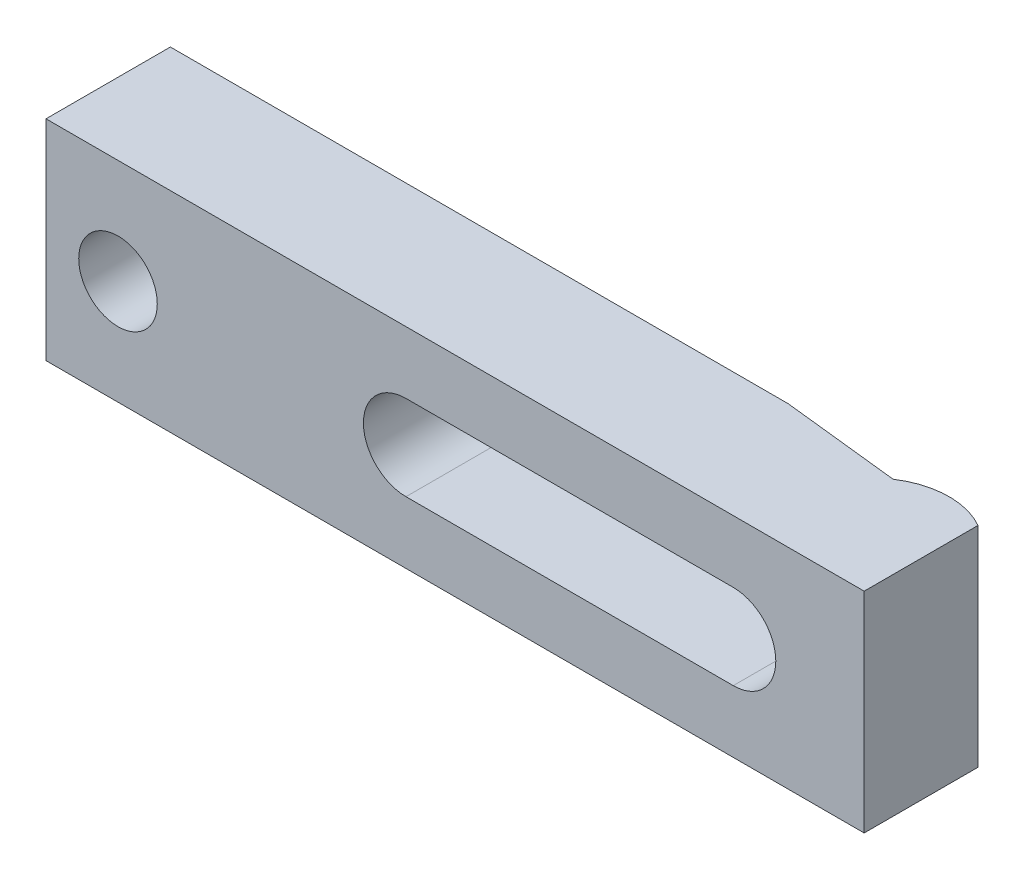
ISO-10303-21;
HEADER;
FILE_DESCRIPTION(('STEP AP214'),'2;1');
FILE_NAME('part.step','',(''),(''),'','','');
FILE_SCHEMA(('AUTOMOTIVE_DESIGN { 1 0 10303 214 1 1 1 1 }'));
ENDSEC;
DATA;
#1=APPLICATION_CONTEXT('core data for automotive mechanical design processes');
#2=APPLICATION_PROTOCOL_DEFINITION('international standard','automotive_design',2000,#1);
#3=PRODUCT_CONTEXT('',#1,'mechanical');
#4=PRODUCT('Part','Part','',(#3));
#5=PRODUCT_RELATED_PRODUCT_CATEGORY('part','',(#4));
#6=PRODUCT_DEFINITION_FORMATION('','',#4);
#7=PRODUCT_DEFINITION_CONTEXT('part definition',#1,'design');
#8=PRODUCT_DEFINITION('design','',#6,#7);
#9=PRODUCT_DEFINITION_SHAPE('','',#8);
#10=(LENGTH_UNIT() NAMED_UNIT(*) SI_UNIT(.MILLI.,.METRE.));
#11=(NAMED_UNIT(*) PLANE_ANGLE_UNIT() SI_UNIT($,.RADIAN.));
#12=(NAMED_UNIT(*) SI_UNIT($,.STERADIAN.) SOLID_ANGLE_UNIT());
#13=UNCERTAINTY_MEASURE_WITH_UNIT(LENGTH_MEASURE(1.E-05),#10,'distance_accuracy_value','');
#14=(GEOMETRIC_REPRESENTATION_CONTEXT(3) GLOBAL_UNCERTAINTY_ASSIGNED_CONTEXT((#13)) GLOBAL_UNIT_ASSIGNED_CONTEXT((#10,
#11,#12)) REPRESENTATION_CONTEXT('',''));
#15=CARTESIAN_POINT('',(0.,0.,0.));
#16=DIRECTION('',(0.,0.,1.));
#17=DIRECTION('',(1.,0.,0.));
#18=AXIS2_PLACEMENT_3D('',#15,#16,#17);
#19=CARTESIAN_POINT('',(-105.,16.,0.));
#20=DIRECTION('',(0.,0.,-1.));
#21=DIRECTION('',(-1.,0.,0.));
#22=AXIS2_PLACEMENT_3D('',#19,#20,#21);
#23=PLANE('',#22);
#24=DIRECTION('',(1.,0.,0.));
#25=VECTOR('',#24,1.);
#26=CARTESIAN_POINT('',(-50.,6.5,0.));
#27=LINE('',#26,#25);
#28=CARTESIAN_POINT('',(-105.,6.5,0.));
#29=VERTEX_POINT('',#28);
#30=CARTESIAN_POINT('',(-10.6,6.5,0.));
#31=VERTEX_POINT('',#30);
#32=EDGE_CURVE('E122',#29,#31,#27,.T.);
#33=ORIENTED_EDGE('',*,*,#32,.F.);
#34=DIRECTION('',(0.,-1.,0.));
#35=VECTOR('',#34,1.);
#36=CARTESIAN_POINT('',(-105.,16.,0.));
#37=LINE('',#36,#35);
#38=CARTESIAN_POINT('',(-105.,16.,0.));
#39=VERTEX_POINT('',#38);
#40=EDGE_CURVE('E139',#39,#29,#37,.T.);
#41=ORIENTED_EDGE('',*,*,#40,.F.);
#42=DIRECTION('',(1.,0.,0.));
#43=VECTOR('',#42,1.);
#44=CARTESIAN_POINT('',(-105.,16.,0.));
#45=LINE('',#44,#43);
#46=CARTESIAN_POINT('',(-10.6,16.,0.));
#47=VERTEX_POINT('',#46);
#48=EDGE_CURVE('E196',#39,#47,#45,.T.);
#49=ORIENTED_EDGE('',*,*,#48,.T.);
#50=DIRECTION('',(0.,-1.,0.));
#51=VECTOR('',#50,1.);
#52=CARTESIAN_POINT('',(-10.6,16.,0.));
#53=LINE('',#52,#51);
#54=EDGE_CURVE('E147',#47,#31,#53,.T.);
#55=ORIENTED_EDGE('',*,*,#54,.T.);
#56=EDGE_LOOP('',(#33,#41,#49,#55));
#57=FACE_BOUND('',#56,.T.);
#58=ADVANCED_FACE('F14',(#57),#23,.T.);
#59=CARTESIAN_POINT('',(-105.,16.,19.));
#60=DIRECTION('',(-1.,0.,0.));
#61=DIRECTION('',(0.,0.,1.));
#62=AXIS2_PLACEMENT_3D('',#59,#60,#61);
#63=PLANE('',#62);
#64=ORIENTED_EDGE('',*,*,#40,.T.);
#65=DIRECTION('',(0.,0.,1.));
#66=VECTOR('',#65,1.);
#67=CARTESIAN_POINT('',(-105.,6.5,19.));
#68=LINE('',#67,#66);
#69=CARTESIAN_POINT('',(-105.,6.5,5.));
#70=VERTEX_POINT('',#69);
#71=EDGE_CURVE('E133',#29,#70,#68,.T.);
#72=ORIENTED_EDGE('',*,*,#71,.T.);
#73=DIRECTION('',(0.,-1.,0.));
#74=VECTOR('',#73,1.);
#75=CARTESIAN_POINT('',(-105.,16.,5.));
#76=LINE('',#75,#74);
#77=CARTESIAN_POINT('',(-105.,-6.5,5.));
#78=VERTEX_POINT('',#77);
#79=EDGE_CURVE('E132',#70,#78,#76,.T.);
#80=ORIENTED_EDGE('',*,*,#79,.T.);
#81=DIRECTION('',(0.,0.,1.));
#82=VECTOR('',#81,1.);
#83=CARTESIAN_POINT('',(-105.,-6.5,19.));
#84=LINE('',#83,#82);
#85=CARTESIAN_POINT('',(-105.,-6.5,0.));
#86=VERTEX_POINT('',#85);
#87=EDGE_CURVE('E115',#86,#78,#84,.T.);
#88=ORIENTED_EDGE('',*,*,#87,.F.);
#89=CARTESIAN_POINT('',(-105.,-16.,0.));
#90=VERTEX_POINT('',#89);
#91=EDGE_CURVE('E129',#86,#90,#37,.T.);
#92=ORIENTED_EDGE('',*,*,#91,.T.);
#93=DIRECTION('',(0.,0.,-1.));
#94=VECTOR('',#93,1.);
#95=CARTESIAN_POINT('',(-105.,-16.,19.));
#96=LINE('',#95,#94);
#97=CARTESIAN_POINT('',(-105.,-16.,19.));
#98=VERTEX_POINT('',#97);
#99=EDGE_CURVE('E169',#98,#90,#96,.T.);
#100=ORIENTED_EDGE('',*,*,#99,.F.);
#101=DIRECTION('',(0.,-1.,0.));
#102=VECTOR('',#101,1.);
#103=CARTESIAN_POINT('',(-105.,16.,19.));
#104=LINE('',#103,#102);
#105=CARTESIAN_POINT('',(-105.,16.,19.));
#106=VERTEX_POINT('',#105);
#107=EDGE_CURVE('E140',#106,#98,#104,.T.);
#108=ORIENTED_EDGE('',*,*,#107,.F.);
#109=DIRECTION('',(0.,0.,-1.));
#110=VECTOR('',#109,1.);
#111=CARTESIAN_POINT('',(-105.,16.,19.));
#112=LINE('',#111,#110);
#113=EDGE_CURVE('E179',#106,#39,#112,.T.);
#114=ORIENTED_EDGE('',*,*,#113,.T.);
#115=EDGE_LOOP('',(#64,#72,#80,#88,#92,#100,#108,#114));
#116=FACE_BOUND('',#115,.T.);
#117=ADVANCED_FACE('F127',(#116),#63,.T.);
#118=CARTESIAN_POINT('',(-50.,0.,19.));
#119=DIRECTION('',(0.,0.,-1.));
#120=DIRECTION('',(-1.,0.,0.));
#121=AXIS2_PLACEMENT_3D('',#118,#119,#120);
#122=CYLINDRICAL_SURFACE('',#121,6.5);
#123=DIRECTION('',(0.,0.,-1.));
#124=VECTOR('',#123,1.);
#125=CARTESIAN_POINT('',(-50.,-6.5,19.));
#126=LINE('',#125,#124);
#127=CARTESIAN_POINT('',(-50.,-6.5,19.));
#128=VERTEX_POINT('',#127);
#129=CARTESIAN_POINT('',(-50.,-6.5,5.));
#130=VERTEX_POINT('',#129);
#131=EDGE_CURVE('E229',#128,#130,#126,.T.);
#132=ORIENTED_EDGE('',*,*,#131,.T.);
#133=CARTESIAN_POINT('',(-50.,0.,5.));
#134=DIRECTION('',(0.,0.,-1.));
#135=DIRECTION('',(-1.,0.,0.));
#136=AXIS2_PLACEMENT_3D('',#133,#134,#135);
#137=CIRCLE('',#136,6.5);
#138=CARTESIAN_POINT('',(-50.,6.5,5.));
#139=VERTEX_POINT('',#138);
#140=EDGE_CURVE('E245',#130,#139,#137,.T.);
#141=ORIENTED_EDGE('',*,*,#140,.T.);
#142=DIRECTION('',(0.,0.,-1.));
#143=VECTOR('',#142,1.);
#144=CARTESIAN_POINT('',(-50.,6.5,19.));
#145=LINE('',#144,#143);
#146=CARTESIAN_POINT('',(-50.,6.5,19.));
#147=VERTEX_POINT('',#146);
#148=EDGE_CURVE('E231',#147,#139,#145,.T.);
#149=ORIENTED_EDGE('',*,*,#148,.F.);
#150=CARTESIAN_POINT('',(-50.,0.,19.));
#151=DIRECTION('',(0.,0.,1.));
#152=DIRECTION('',(1.,0.,0.));
#153=AXIS2_PLACEMENT_3D('',#150,#151,#152);
#154=CIRCLE('',#153,6.5);
#155=EDGE_CURVE('E38',#147,#128,#154,.T.);
#156=ORIENTED_EDGE('',*,*,#155,.T.);
#157=EDGE_LOOP('',(#132,#141,#149,#156));
#158=FACE_BOUND('',#157,.T.);
#159=ADVANCED_FACE('F244',(#158),#122,.F.);
#160=CARTESIAN_POINT('',(-94.,0.,19.));
#161=DIRECTION('',(0.,0.,-1.));
#162=DIRECTION('',(-1.,0.,0.));
#163=AXIS2_PLACEMENT_3D('',#160,#161,#162);
#164=CYLINDRICAL_SURFACE('',#163,6.);
#165=CARTESIAN_POINT('',(-94.,0.,19.));
#166=DIRECTION('',(0.,0.,1.));
#167=DIRECTION('',(1.,0.,0.));
#168=AXIS2_PLACEMENT_3D('',#165,#166,#167);
#169=CIRCLE('',#168,6.);
#170=CARTESIAN_POINT('',(-88.,0.,19.));
#171=VERTEX_POINT('',#170);
#172=EDGE_CURVE('E209',#171,#171,#169,.T.);
#173=ORIENTED_EDGE('',*,*,#172,.T.);
#174=EDGE_LOOP('',(#173));
#175=FACE_BOUND('',#174,.T.);
#176=CARTESIAN_POINT('',(-94.,0.,5.));
#177=DIRECTION('',(0.,0.,-1.));
#178=DIRECTION('',(-1.,0.,0.));
#179=AXIS2_PLACEMENT_3D('',#176,#177,#178);
#180=CIRCLE('',#179,6.);
#181=CARTESIAN_POINT('',(-100.,0.,5.));
#182=VERTEX_POINT('',#181);
#183=EDGE_CURVE('E18',#182,#182,#180,.T.);
#184=ORIENTED_EDGE('',*,*,#183,.T.);
#185=EDGE_LOOP('',(#184));
#186=FACE_BOUND('',#185,.T.);
#187=ADVANCED_FACE('F275',(#175,#186),#164,.F.);
#188=CARTESIAN_POINT('',(20.,16.,19.));
#189=DIRECTION('',(0.,0.,1.));
#190=DIRECTION('',(1.,0.,0.));
#191=AXIS2_PLACEMENT_3D('',#188,#189,#190);
#192=PLANE('',#191);
#193=DIRECTION('',(1.,0.,0.));
#194=VECTOR('',#193,1.);
#195=CARTESIAN_POINT('',(-50.,6.5,19.));
#196=LINE('',#195,#194);
#197=CARTESIAN_POINT('',(0.,6.5,19.));
#198=VERTEX_POINT('',#197);
#199=EDGE_CURVE('E223',#147,#198,#196,.T.);
#200=ORIENTED_EDGE('',*,*,#199,.T.);
#201=CARTESIAN_POINT('',(0.,0.,19.));
#202=DIRECTION('',(0.,0.,1.));
#203=DIRECTION('',(1.,0.,0.));
#204=AXIS2_PLACEMENT_3D('',#201,#202,#203);
#205=CIRCLE('',#204,6.5);
#206=CARTESIAN_POINT('',(0.,-6.5,19.));
#207=VERTEX_POINT('',#206);
#208=EDGE_CURVE('E121',#207,#198,#205,.T.);
#209=ORIENTED_EDGE('',*,*,#208,.F.);
#210=DIRECTION('',(-1.,0.,0.));
#211=VECTOR('',#210,1.);
#212=CARTESIAN_POINT('',(0.,-6.5,19.));
#213=LINE('',#212,#211);
#214=EDGE_CURVE('E218',#207,#128,#213,.T.);
#215=ORIENTED_EDGE('',*,*,#214,.T.);
#216=ORIENTED_EDGE('',*,*,#155,.F.);
#217=EDGE_LOOP('',(#200,#209,#215,#216));
#218=FACE_BOUND('',#217,.T.);
#219=DIRECTION('',(0.,-1.,0.));
#220=VECTOR('',#219,1.);
#221=CARTESIAN_POINT('',(20.,16.,19.));
#222=LINE('',#221,#220);
#223=CARTESIAN_POINT('',(20.,16.,19.));
#224=VERTEX_POINT('',#223);
#225=CARTESIAN_POINT('',(20.,-16.,19.));
#226=VERTEX_POINT('',#225);
#227=EDGE_CURVE('E23',#224,#226,#222,.T.);
#228=ORIENTED_EDGE('',*,*,#227,.F.);
#229=DIRECTION('',(-1.,0.,0.));
#230=VECTOR('',#229,1.);
#231=CARTESIAN_POINT('',(20.,16.,19.));
#232=LINE('',#231,#230);
#233=EDGE_CURVE('E177',#224,#106,#232,.T.);
#234=ORIENTED_EDGE('',*,*,#233,.T.);
#235=ORIENTED_EDGE('',*,*,#107,.T.);
#236=DIRECTION('',(-1.,0.,0.));
#237=VECTOR('',#236,1.);
#238=CARTESIAN_POINT('',(20.,-16.,19.));
#239=LINE('',#238,#237);
#240=EDGE_CURVE('E165',#226,#98,#239,.T.);
#241=ORIENTED_EDGE('',*,*,#240,.F.);
#242=EDGE_LOOP('',(#228,#234,#235,#241));
#243=FACE_BOUND('',#242,.T.);
#244=ORIENTED_EDGE('',*,*,#172,.F.);
#245=EDGE_LOOP('',(#244));
#246=FACE_BOUND('',#245,.T.);
#247=ADVANCED_FACE('F166',(#218,#243,#246),#192,.T.);
#248=ORIENTED_EDGE('',*,*,#91,.F.);
#249=DIRECTION('',(-1.,0.,0.));
#250=VECTOR('',#249,1.);
#251=CARTESIAN_POINT('',(0.,-6.5,0.));
#252=LINE('',#251,#250);
#253=CARTESIAN_POINT('',(-10.6,-6.5,0.));
#254=VERTEX_POINT('',#253);
#255=EDGE_CURVE('E110',#254,#86,#252,.T.);
#256=ORIENTED_EDGE('',*,*,#255,.F.);
#257=CARTESIAN_POINT('',(-10.6,-16.,0.));
#258=VERTEX_POINT('',#257);
#259=EDGE_CURVE('E142',#254,#258,#53,.T.);
#260=ORIENTED_EDGE('',*,*,#259,.T.);
#261=DIRECTION('',(1.,0.,0.));
#262=VECTOR('',#261,1.);
#263=CARTESIAN_POINT('',(-105.,-16.,0.));
#264=LINE('',#263,#262);
#265=EDGE_CURVE('E138',#90,#258,#264,.T.);
#266=ORIENTED_EDGE('',*,*,#265,.F.);
#267=EDGE_LOOP('',(#248,#256,#260,#266));
#268=FACE_BOUND('',#267,.T.);
#269=ADVANCED_FACE('F136',(#268),#23,.T.);
#270=CARTESIAN_POINT('',(20.,16.,19.));
#271=DIRECTION('',(-1.,0.,0.));
#272=DIRECTION('',(0.,0.,1.));
#273=AXIS2_PLACEMENT_3D('',#270,#271,#272);
#274=PLANE('',#273);
#275=DIRECTION('',(0.,-1.,0.));
#276=VECTOR('',#275,1.);
#277=CARTESIAN_POINT('',(20.,16.,1.60769515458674));
#278=LINE('',#277,#276);
#279=CARTESIAN_POINT('',(20.,16.,1.60769515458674));
#280=VERTEX_POINT('',#279);
#281=CARTESIAN_POINT('',(20.,-16.,1.60769515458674));
#282=VERTEX_POINT('',#281);
#283=EDGE_CURVE('E152',#280,#282,#278,.T.);
#284=ORIENTED_EDGE('',*,*,#283,.F.);
#285=DIRECTION('',(0.,0.,-1.));
#286=VECTOR('',#285,1.);
#287=CARTESIAN_POINT('',(20.,16.,19.));
#288=LINE('',#287,#286);
#289=EDGE_CURVE('E143',#224,#280,#288,.T.);
#290=ORIENTED_EDGE('',*,*,#289,.F.);
#291=ORIENTED_EDGE('',*,*,#227,.T.);
#292=DIRECTION('',(0.,0.,-1.));
#293=VECTOR('',#292,1.);
#294=CARTESIAN_POINT('',(20.,-16.,19.));
#295=LINE('',#294,#293);
#296=EDGE_CURVE('E159',#226,#282,#295,.T.);
#297=ORIENTED_EDGE('',*,*,#296,.T.);
#298=EDGE_LOOP('',(#284,#290,#291,#297));
#299=FACE_BOUND('',#298,.T.);
#300=ADVANCED_FACE('F16',(#299),#274,.F.);
#301=CARTESIAN_POINT('',(14.,16.,12.));
#302=DIRECTION('',(0.,-1.,0.));
#303=DIRECTION('',(0.,0.,-1.));
#304=AXIS2_PLACEMENT_3D('',#301,#302,#303);
#305=CYLINDRICAL_SURFACE('',#304,12.);
#306=DIRECTION('',(0.,-1.,0.));
#307=VECTOR('',#306,1.);
#308=CARTESIAN_POINT('',(7.4,16.,1.97802414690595));
#309=LINE('',#308,#307);
#310=CARTESIAN_POINT('',(7.4,16.,1.97802414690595));
#311=VERTEX_POINT('',#310);
#312=CARTESIAN_POINT('',(7.4,-16.,1.97802414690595));
#313=VERTEX_POINT('',#312);
#314=EDGE_CURVE('E150',#311,#313,#309,.T.);
#315=ORIENTED_EDGE('',*,*,#314,.F.);
#316=CARTESIAN_POINT('',(14.,16.,12.));
#317=DIRECTION('',(0.,1.,0.));
#318=DIRECTION('',(0.,0.,1.));
#319=AXIS2_PLACEMENT_3D('',#316,#317,#318);
#320=CIRCLE('',#319,12.);
#321=EDGE_CURVE('E190',#280,#311,#320,.T.);
#322=ORIENTED_EDGE('',*,*,#321,.F.);
#323=ORIENTED_EDGE('',*,*,#283,.T.);
#324=CARTESIAN_POINT('',(14.,-16.,12.));
#325=DIRECTION('',(0.,1.,0.));
#326=DIRECTION('',(0.,0.,1.));
#327=AXIS2_PLACEMENT_3D('',#324,#325,#326);
#328=CIRCLE('',#327,12.);
#329=EDGE_CURVE('E176',#282,#313,#328,.T.);
#330=ORIENTED_EDGE('',*,*,#329,.T.);
#331=EDGE_LOOP('',(#315,#322,#323,#330));
#332=FACE_BOUND('',#331,.T.);
#333=ADVANCED_FACE('F274',(#332),#305,.T.);
#334=CARTESIAN_POINT('',(7.4,16.,1.97802414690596));
#335=DIRECTION('',(-0.109232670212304,0.,0.99401620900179));
#336=DIRECTION('',(0.99401620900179,0.,0.109232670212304));
#337=AXIS2_PLACEMENT_3D('',#334,#335,#336);
#338=PLANE('',#337);
#339=CARTESIAN_POINT('',(0.,0.,1.16483644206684));
#340=DIRECTION('',(-0.109232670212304,0.,0.99401620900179));
#341=DIRECTION('',(-0.99401620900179,0.,-0.109232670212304));
#342=AXIS2_PLACEMENT_3D('',#339,#340,#341);
#343=ELLIPSE('',#342,6.53912877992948,6.5);
#344=CARTESIAN_POINT('',(0.,6.5,1.16483644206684));
#345=VERTEX_POINT('',#344);
#346=CARTESIAN_POINT('',(0.,-6.5,1.16483644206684));
#347=VERTEX_POINT('',#346);
#348=EDGE_CURVE('E9',#345,#347,#343,.F.);
#349=ORIENTED_EDGE('',*,*,#348,.F.);
#350=DIRECTION('',(-0.99401620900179,0.,-0.109232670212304));
#351=VECTOR('',#350,1.);
#352=CARTESIAN_POINT('',(7.4,6.5,1.97802414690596));
#353=LINE('',#352,#351);
#354=EDGE_CURVE('E170',#345,#31,#353,.T.);
#355=ORIENTED_EDGE('',*,*,#354,.T.);
#356=ORIENTED_EDGE('',*,*,#54,.F.);
#357=DIRECTION('',(-0.99401620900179,0.,-0.109232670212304));
#358=VECTOR('',#357,1.);
#359=CARTESIAN_POINT('',(7.4,16.,1.97802414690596));
#360=LINE('',#359,#358);
#361=EDGE_CURVE('E193',#311,#47,#360,.T.);
#362=ORIENTED_EDGE('',*,*,#361,.F.);
#363=ORIENTED_EDGE('',*,*,#314,.T.);
#364=DIRECTION('',(-0.99401620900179,0.,-0.109232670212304));
#365=VECTOR('',#364,1.);
#366=CARTESIAN_POINT('',(7.4,-16.,1.97802414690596));
#367=LINE('',#366,#365);
#368=EDGE_CURVE('E180',#313,#258,#367,.T.);
#369=ORIENTED_EDGE('',*,*,#368,.T.);
#370=ORIENTED_EDGE('',*,*,#259,.F.);
#371=DIRECTION('',(0.99401620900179,0.,0.109232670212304));
#372=VECTOR('',#371,1.);
#373=CARTESIAN_POINT('',(7.4,-6.5,1.97802414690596));
#374=LINE('',#373,#372);
#375=EDGE_CURVE('E117',#254,#347,#374,.T.);
#376=ORIENTED_EDGE('',*,*,#375,.T.);
#377=EDGE_LOOP('',(#349,#355,#356,#362,#363,#369,#370,#376));
#378=FACE_BOUND('',#377,.T.);
#379=ADVANCED_FACE('F237',(#378),#338,.F.);
#380=CARTESIAN_POINT('',(14.,16.,12.));
#381=DIRECTION('',(0.,1.,0.));
#382=DIRECTION('',(0.,0.,1.));
#383=AXIS2_PLACEMENT_3D('',#380,#381,#382);
#384=PLANE('',#383);
#385=ORIENTED_EDGE('',*,*,#233,.F.);
#386=ORIENTED_EDGE('',*,*,#289,.T.);
#387=ORIENTED_EDGE('',*,*,#321,.T.);
#388=ORIENTED_EDGE('',*,*,#361,.T.);
#389=ORIENTED_EDGE('',*,*,#48,.F.);
#390=ORIENTED_EDGE('',*,*,#113,.F.);
#391=EDGE_LOOP('',(#385,#386,#387,#388,#389,#390));
#392=FACE_BOUND('',#391,.T.);
#393=ADVANCED_FACE('F203',(#392),#384,.T.);
#394=CARTESIAN_POINT('',(14.,-16.,12.));
#395=DIRECTION('',(0.,1.,0.));
#396=DIRECTION('',(0.,0.,1.));
#397=AXIS2_PLACEMENT_3D('',#394,#395,#396);
#398=PLANE('',#397);
#399=ORIENTED_EDGE('',*,*,#240,.T.);
#400=ORIENTED_EDGE('',*,*,#99,.T.);
#401=ORIENTED_EDGE('',*,*,#265,.T.);
#402=ORIENTED_EDGE('',*,*,#368,.F.);
#403=ORIENTED_EDGE('',*,*,#329,.F.);
#404=ORIENTED_EDGE('',*,*,#296,.F.);
#405=EDGE_LOOP('',(#399,#400,#401,#402,#403,#404));
#406=FACE_BOUND('',#405,.T.);
#407=ADVANCED_FACE('F173',(#406),#398,.F.);
#408=CARTESIAN_POINT('',(0.,0.,19.));
#409=DIRECTION('',(0.,0.,-1.));
#410=DIRECTION('',(-1.,0.,0.));
#411=AXIS2_PLACEMENT_3D('',#408,#409,#410);
#412=CYLINDRICAL_SURFACE('',#411,6.5);
#413=ORIENTED_EDGE('',*,*,#348,.T.);
#414=DIRECTION('',(0.,0.,-1.));
#415=VECTOR('',#414,1.);
#416=CARTESIAN_POINT('',(0.,-6.5,19.));
#417=LINE('',#416,#415);
#418=EDGE_CURVE('E221',#207,#347,#417,.T.);
#419=ORIENTED_EDGE('',*,*,#418,.F.);
#420=ORIENTED_EDGE('',*,*,#208,.T.);
#421=DIRECTION('',(0.,0.,-1.));
#422=VECTOR('',#421,1.);
#423=CARTESIAN_POINT('',(0.,6.5,19.));
#424=LINE('',#423,#422);
#425=EDGE_CURVE('E233',#198,#345,#424,.T.);
#426=ORIENTED_EDGE('',*,*,#425,.T.);
#427=EDGE_LOOP('',(#413,#419,#420,#426));
#428=FACE_BOUND('',#427,.T.);
#429=ADVANCED_FACE('F240',(#428),#412,.F.);
#430=CARTESIAN_POINT('',(-50.,6.5,19.));
#431=DIRECTION('',(0.,1.,0.));
#432=DIRECTION('',(-1.,0.,0.));
#433=AXIS2_PLACEMENT_3D('',#430,#431,#432);
#434=PLANE('',#433);
#435=ORIENTED_EDGE('',*,*,#32,.T.);
#436=ORIENTED_EDGE('',*,*,#354,.F.);
#437=ORIENTED_EDGE('',*,*,#425,.F.);
#438=ORIENTED_EDGE('',*,*,#199,.F.);
#439=ORIENTED_EDGE('',*,*,#148,.T.);
#440=DIRECTION('',(-1.,0.,0.));
#441=VECTOR('',#440,1.);
#442=CARTESIAN_POINT('',(-10.,6.5,5.));
#443=LINE('',#442,#441);
#444=EDGE_CURVE('E30',#139,#70,#443,.T.);
#445=ORIENTED_EDGE('',*,*,#444,.T.);
#446=ORIENTED_EDGE('',*,*,#71,.F.);
#447=EDGE_LOOP('',(#435,#436,#437,#438,#439,#445,#446));
#448=FACE_BOUND('',#447,.T.);
#449=ADVANCED_FACE('F211',(#448),#434,.F.);
#450=CARTESIAN_POINT('',(0.,-6.5,19.));
#451=DIRECTION('',(0.,-1.,0.));
#452=DIRECTION('',(1.,0.,0.));
#453=AXIS2_PLACEMENT_3D('',#450,#451,#452);
#454=PLANE('',#453);
#455=ORIENTED_EDGE('',*,*,#418,.T.);
#456=ORIENTED_EDGE('',*,*,#375,.F.);
#457=ORIENTED_EDGE('',*,*,#255,.T.);
#458=ORIENTED_EDGE('',*,*,#87,.T.);
#459=DIRECTION('',(-1.,0.,0.));
#460=VECTOR('',#459,1.);
#461=CARTESIAN_POINT('',(-10.,-6.5,5.));
#462=LINE('',#461,#460);
#463=EDGE_CURVE('E249',#130,#78,#462,.T.);
#464=ORIENTED_EDGE('',*,*,#463,.F.);
#465=ORIENTED_EDGE('',*,*,#131,.F.);
#466=ORIENTED_EDGE('',*,*,#214,.F.);
#467=EDGE_LOOP('',(#455,#456,#457,#458,#464,#465,#466));
#468=FACE_BOUND('',#467,.T.);
#469=ADVANCED_FACE('F113',(#468),#454,.F.);
#470=CARTESIAN_POINT('',(-10.,6.5,5.));
#471=DIRECTION('',(0.,0.,-1.));
#472=DIRECTION('',(-1.,0.,0.));
#473=AXIS2_PLACEMENT_3D('',#470,#471,#472);
#474=PLANE('',#473);
#475=ORIENTED_EDGE('',*,*,#183,.F.);
#476=EDGE_LOOP('',(#475));
#477=FACE_BOUND('',#476,.T.);
#478=ORIENTED_EDGE('',*,*,#444,.F.);
#479=ORIENTED_EDGE('',*,*,#140,.F.);
#480=ORIENTED_EDGE('',*,*,#463,.T.);
#481=ORIENTED_EDGE('',*,*,#79,.F.);
#482=EDGE_LOOP('',(#478,#479,#480,#481));
#483=FACE_BOUND('',#482,.T.);
#484=ADVANCED_FACE('F251',(#477,#483),#474,.T.);
#485=CLOSED_SHELL('',(#58,#117,#159,#187,#247,#269,#300,#333,#379,#393,#407,#429,#449,#469,#484));
#486=MANIFOLD_SOLID_BREP('B1',#485);
#487=ADVANCED_BREP_SHAPE_REPRESENTATION('',(#18,#486),#14);
#488=SHAPE_DEFINITION_REPRESENTATION(#9,#487);
ENDSEC;
END-ISO-10303-21;
